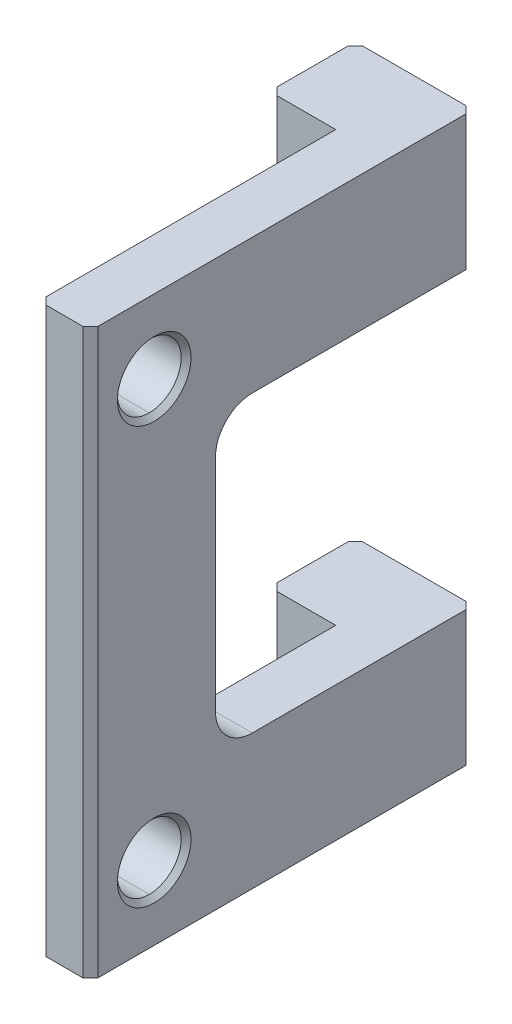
ISO-10303-21;
HEADER;
FILE_DESCRIPTION(('STEP AP214'),'2;1');
FILE_NAME('part.step','',(''),(''),'','','');
FILE_SCHEMA(('AUTOMOTIVE_DESIGN { 1 0 10303 214 1 1 1 1 }'));
ENDSEC;
DATA;
#1=APPLICATION_CONTEXT('core data for automotive mechanical design processes');
#2=APPLICATION_PROTOCOL_DEFINITION('international standard','automotive_design',2000,#1);
#3=PRODUCT_CONTEXT('',#1,'mechanical');
#4=PRODUCT('Part','Part','',(#3));
#5=PRODUCT_RELATED_PRODUCT_CATEGORY('part','',(#4));
#6=PRODUCT_DEFINITION_FORMATION('','',#4);
#7=PRODUCT_DEFINITION_CONTEXT('part definition',#1,'design');
#8=PRODUCT_DEFINITION('design','',#6,#7);
#9=PRODUCT_DEFINITION_SHAPE('','',#8);
#10=(LENGTH_UNIT() NAMED_UNIT(*) SI_UNIT(.MILLI.,.METRE.));
#11=(NAMED_UNIT(*) PLANE_ANGLE_UNIT() SI_UNIT($,.RADIAN.));
#12=(NAMED_UNIT(*) SI_UNIT($,.STERADIAN.) SOLID_ANGLE_UNIT());
#13=UNCERTAINTY_MEASURE_WITH_UNIT(LENGTH_MEASURE(1.E-05),#10,'distance_accuracy_value','');
#14=(GEOMETRIC_REPRESENTATION_CONTEXT(3) GLOBAL_UNCERTAINTY_ASSIGNED_CONTEXT((#13)) GLOBAL_UNIT_ASSIGNED_CONTEXT((#10,
#11,#12)) REPRESENTATION_CONTEXT('',''));
#15=CARTESIAN_POINT('',(0.,0.,0.));
#16=DIRECTION('',(0.,0.,1.));
#17=DIRECTION('',(1.,0.,0.));
#18=AXIS2_PLACEMENT_3D('',#15,#16,#17);
#19=CARTESIAN_POINT('',(51.9,-208.5,-24.175625));
#20=DIRECTION('',(0.,0.,-1.));
#21=DIRECTION('',(-1.,0.,0.));
#22=AXIS2_PLACEMENT_3D('',#19,#20,#21);
#23=CYLINDRICAL_SURFACE('',#22,1.02500000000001);
#24=DIRECTION('',(0.,0.,-1.));
#25=VECTOR('',#24,1.);
#26=CARTESIAN_POINT('',(52.,-209.520110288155,-24.175625));
#27=LINE('',#26,#25);
#28=CARTESIAN_POINT('',(52.,-209.520110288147,-24.0000000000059));
#29=VERTEX_POINT('',#28);
#30=CARTESIAN_POINT('',(52.,-209.520110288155,-24.5));
#31=VERTEX_POINT('',#30);
#32=EDGE_CURVE('E340',#29,#31,#27,.T.);
#33=ORIENTED_EDGE('',*,*,#32,.F.);
#34=CARTESIAN_POINT('',(51.9,-208.500000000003,-24.0000000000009));
#35=DIRECTION('',(0.,0.,-1.));
#36=DIRECTION('',(-1.,0.,0.));
#37=AXIS2_PLACEMENT_3D('',#34,#35,#36);
#38=CIRCLE('',#37,1.02499999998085);
#39=CARTESIAN_POINT('',(52.,-207.479889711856,-24.0000000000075));
#40=VERTEX_POINT('',#39);
#41=EDGE_CURVE('E239',#29,#40,#38,.F.);
#42=ORIENTED_EDGE('',*,*,#41,.T.);
#43=DIRECTION('',(0.,0.,-1.));
#44=VECTOR('',#43,1.);
#45=CARTESIAN_POINT('',(52.,-207.479889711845,-24.175625));
#46=LINE('',#45,#44);
#47=CARTESIAN_POINT('',(52.,-207.479889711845,-24.5));
#48=VERTEX_POINT('',#47);
#49=EDGE_CURVE('E343',#48,#40,#46,.F.);
#50=ORIENTED_EDGE('',*,*,#49,.F.);
#51=CARTESIAN_POINT('',(51.9,-208.5,-24.5));
#52=DIRECTION('',(0.,0.,-1.));
#53=DIRECTION('',(-1.,0.,0.));
#54=AXIS2_PLACEMENT_3D('',#51,#52,#53);
#55=CIRCLE('',#54,1.02500000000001);
#56=EDGE_CURVE('E728',#31,#48,#55,.T.);
#57=ORIENTED_EDGE('',*,*,#56,.F.);
#58=EDGE_LOOP('',(#33,#42,#50,#57));
#59=FACE_BOUND('',#58,.T.);
#60=CARTESIAN_POINT('',(51.9,-208.5,-27.7437499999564));
#61=DIRECTION('',(0.,0.,-1.));
#62=DIRECTION('',(-1.,0.,0.));
#63=AXIS2_PLACEMENT_3D('',#60,#61,#62);
#64=CIRCLE('',#63,1.02500000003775);
#65=CARTESIAN_POINT('',(50.8749999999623,-208.5,-27.7437499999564));
#66=VERTEX_POINT('',#65);
#67=EDGE_CURVE('E342',#66,#66,#64,.T.);
#68=ORIENTED_EDGE('',*,*,#67,.T.);
#69=EDGE_LOOP('',(#68));
#70=FACE_BOUND('',#69,.T.);
#71=ADVANCED_FACE('F17',(#59,#70),#23,.F.);
#72=CARTESIAN_POINT('',(51.9,-208.5,-27.9999999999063));
#73=DIRECTION('',(0.,0.,-1.));
#74=DIRECTION('',(-1.,0.,0.));
#75=AXIS2_PLACEMENT_3D('',#72,#73,#74);
#76=CONICAL_SURFACE('',#75,1.28124999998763,0.785398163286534);
#77=CARTESIAN_POINT('',(51.9,-208.5,-27.9999999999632));
#78=DIRECTION('',(0.,0.,-1.));
#79=DIRECTION('',(-1.,0.,0.));
#80=AXIS2_PLACEMENT_3D('',#77,#78,#79);
#81=CIRCLE('',#80,1.28125000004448);
#82=CARTESIAN_POINT('',(50.6187499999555,-208.5,-27.9999999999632));
#83=VERTEX_POINT('',#82);
#84=EDGE_CURVE('E720',#83,#83,#81,.F.);
#85=ORIENTED_EDGE('',*,*,#84,.F.);
#86=EDGE_LOOP('',(#85));
#87=FACE_BOUND('',#86,.T.);
#88=ORIENTED_EDGE('',*,*,#67,.F.);
#89=EDGE_LOOP('',(#88));
#90=FACE_BOUND('',#89,.T.);
#91=ADVANCED_FACE('F783',(#87,#90),#76,.F.);
#92=CARTESIAN_POINT('',(49.6,-211.,-24.5));
#93=DIRECTION('',(-0.707106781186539,0.,0.707106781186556));
#94=DIRECTION('',(0.707106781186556,0.,0.707106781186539));
#95=AXIS2_PLACEMENT_3D('',#92,#93,#94);
#96=PLANE('',#95);
#97=DIRECTION('',(0.,1.,0.));
#98=VECTOR('',#97,1.);
#99=CARTESIAN_POINT('',(49.3,-211.,-24.8));
#100=LINE('',#99,#98);
#101=CARTESIAN_POINT('',(49.3,-211.,-24.8));
#102=VERTEX_POINT('',#101);
#103=CARTESIAN_POINT('',(49.3,-205.5,-24.8));
#104=VERTEX_POINT('',#103);
#105=EDGE_CURVE('E376',#102,#104,#100,.T.);
#106=ORIENTED_EDGE('',*,*,#105,.F.);
#107=DIRECTION('',(0.707106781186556,0.,0.707106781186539));
#108=VECTOR('',#107,1.);
#109=CARTESIAN_POINT('',(49.6,-211.,-24.5));
#110=LINE('',#109,#108);
#111=CARTESIAN_POINT('',(49.6,-211.,-24.5));
#112=VERTEX_POINT('',#111);
#113=EDGE_CURVE('E337',#102,#112,#110,.T.);
#114=ORIENTED_EDGE('',*,*,#113,.T.);
#115=DIRECTION('',(0.,1.,0.));
#116=VECTOR('',#115,1.);
#117=CARTESIAN_POINT('',(49.6,-211.,-24.5));
#118=LINE('',#117,#116);
#119=CARTESIAN_POINT('',(49.6,-205.5,-24.5));
#120=VERTEX_POINT('',#119);
#121=EDGE_CURVE('E731',#120,#112,#118,.F.);
#122=ORIENTED_EDGE('',*,*,#121,.F.);
#123=DIRECTION('',(0.707106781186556,0.,0.707106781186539));
#124=VECTOR('',#123,1.);
#125=CARTESIAN_POINT('',(49.6,-205.5,-24.5));
#126=LINE('',#125,#124);
#127=EDGE_CURVE('E182',#120,#104,#126,.F.);
#128=ORIENTED_EDGE('',*,*,#127,.T.);
#129=EDGE_LOOP('',(#106,#114,#122,#128));
#130=FACE_BOUND('',#129,.T.);
#131=ADVANCED_FACE('F779',(#130),#96,.T.);
#132=CARTESIAN_POINT('',(49.3,-211.,-27.7));
#133=DIRECTION('',(-0.707106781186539,0.,-0.707106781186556));
#134=DIRECTION('',(-0.707106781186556,0.,0.707106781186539));
#135=AXIS2_PLACEMENT_3D('',#132,#133,#134);
#136=PLANE('',#135);
#137=DIRECTION('',(0.,1.,0.));
#138=VECTOR('',#137,1.);
#139=CARTESIAN_POINT('',(49.6,-211.,-28.));
#140=LINE('',#139,#138);
#141=CARTESIAN_POINT('',(49.6,-211.,-28.));
#142=VERTEX_POINT('',#141);
#143=CARTESIAN_POINT('',(49.6,-205.5,-28.));
#144=VERTEX_POINT('',#143);
#145=EDGE_CURVE('E717',#142,#144,#140,.T.);
#146=ORIENTED_EDGE('',*,*,#145,.F.);
#147=DIRECTION('',(-0.707106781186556,0.,0.707106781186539));
#148=VECTOR('',#147,1.);
#149=CARTESIAN_POINT('',(49.3,-211.,-27.7));
#150=LINE('',#149,#148);
#151=CARTESIAN_POINT('',(49.3,-211.,-27.7));
#152=VERTEX_POINT('',#151);
#153=EDGE_CURVE('E326',#142,#152,#150,.T.);
#154=ORIENTED_EDGE('',*,*,#153,.T.);
#155=DIRECTION('',(0.,1.,0.));
#156=VECTOR('',#155,1.);
#157=CARTESIAN_POINT('',(49.3,-211.,-27.7));
#158=LINE('',#157,#156);
#159=CARTESIAN_POINT('',(49.3,-205.5,-27.7));
#160=VERTEX_POINT('',#159);
#161=EDGE_CURVE('E373',#160,#152,#158,.F.);
#162=ORIENTED_EDGE('',*,*,#161,.F.);
#163=DIRECTION('',(-0.707106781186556,0.,0.707106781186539));
#164=VECTOR('',#163,1.);
#165=CARTESIAN_POINT('',(49.3,-205.5,-27.7));
#166=LINE('',#165,#164);
#167=EDGE_CURVE('E174',#160,#144,#166,.F.);
#168=ORIENTED_EDGE('',*,*,#167,.T.);
#169=EDGE_LOOP('',(#146,#154,#162,#168));
#170=FACE_BOUND('',#169,.T.);
#171=ADVANCED_FACE('F776',(#170),#136,.T.);
#172=CARTESIAN_POINT('',(51.9,-225.5,-24.175625));
#173=DIRECTION('',(0.,0.,-1.));
#174=DIRECTION('',(-1.,0.,0.));
#175=AXIS2_PLACEMENT_3D('',#172,#173,#174);
#176=CYLINDRICAL_SURFACE('',#175,1.025);
#177=DIRECTION('',(0.,0.,-1.));
#178=VECTOR('',#177,1.);
#179=CARTESIAN_POINT('',(52.,-226.520110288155,-24.175625));
#180=LINE('',#179,#178);
#181=CARTESIAN_POINT('',(52.,-226.520110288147,-23.9999999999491));
#182=VERTEX_POINT('',#181);
#183=CARTESIAN_POINT('',(52.,-226.520110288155,-24.5));
#184=VERTEX_POINT('',#183);
#185=EDGE_CURVE('E317',#182,#184,#180,.T.);
#186=ORIENTED_EDGE('',*,*,#185,.F.);
#187=CARTESIAN_POINT('',(51.8999999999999,-225.500000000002,-23.9999999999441));
#188=DIRECTION('',(0.,0.,-1.));
#189=DIRECTION('',(-1.,0.,0.));
#190=AXIS2_PLACEMENT_3D('',#187,#188,#189);
#191=CIRCLE('',#190,1.02499999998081);
#192=CARTESIAN_POINT('',(52.,-224.479889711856,-23.9999999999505));
#193=VERTEX_POINT('',#192);
#194=EDGE_CURVE('E301',#182,#193,#191,.F.);
#195=ORIENTED_EDGE('',*,*,#194,.T.);
#196=DIRECTION('',(0.,0.,-1.));
#197=VECTOR('',#196,1.);
#198=CARTESIAN_POINT('',(52.,-224.479889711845,-24.175625));
#199=LINE('',#198,#197);
#200=CARTESIAN_POINT('',(52.,-224.479889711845,-24.5));
#201=VERTEX_POINT('',#200);
#202=EDGE_CURVE('E324',#201,#193,#199,.F.);
#203=ORIENTED_EDGE('',*,*,#202,.F.);
#204=CARTESIAN_POINT('',(51.9,-225.5,-24.5));
#205=DIRECTION('',(0.,0.,-1.));
#206=DIRECTION('',(-1.,0.,0.));
#207=AXIS2_PLACEMENT_3D('',#204,#205,#206);
#208=CIRCLE('',#207,1.025);
#209=EDGE_CURVE('E352',#184,#201,#208,.T.);
#210=ORIENTED_EDGE('',*,*,#209,.F.);
#211=EDGE_LOOP('',(#186,#195,#203,#210));
#212=FACE_BOUND('',#211,.T.);
#213=CARTESIAN_POINT('',(51.9,-225.5,-27.7437499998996));
#214=DIRECTION('',(0.,0.,-1.));
#215=DIRECTION('',(-1.,0.,0.));
#216=AXIS2_PLACEMENT_3D('',#213,#214,#215);
#217=CIRCLE('',#216,1.02500000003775);
#218=CARTESIAN_POINT('',(50.8749999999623,-225.5,-27.7437499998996));
#219=VERTEX_POINT('',#218);
#220=EDGE_CURVE('E311',#219,#219,#217,.T.);
#221=ORIENTED_EDGE('',*,*,#220,.T.);
#222=EDGE_LOOP('',(#221));
#223=FACE_BOUND('',#222,.T.);
#224=ADVANCED_FACE('F751',(#212,#223),#176,.F.);
#225=CARTESIAN_POINT('',(49.6,-228.5,-24.5));
#226=DIRECTION('',(-0.707106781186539,0.,0.707106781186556));
#227=DIRECTION('',(0.707106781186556,0.,0.707106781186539));
#228=AXIS2_PLACEMENT_3D('',#225,#226,#227);
#229=PLANE('',#228);
#230=DIRECTION('',(0.,1.,0.));
#231=VECTOR('',#230,1.);
#232=CARTESIAN_POINT('',(49.3,-228.5,-24.8));
#233=LINE('',#232,#231);
#234=CARTESIAN_POINT('',(49.3,-228.5,-24.8));
#235=VERTEX_POINT('',#234);
#236=CARTESIAN_POINT('',(49.3,-223.,-24.8));
#237=VERTEX_POINT('',#236);
#238=EDGE_CURVE('E353',#235,#237,#233,.T.);
#239=ORIENTED_EDGE('',*,*,#238,.F.);
#240=DIRECTION('',(0.707106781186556,0.,0.707106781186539));
#241=VECTOR('',#240,1.);
#242=CARTESIAN_POINT('',(49.6,-228.5,-24.5));
#243=LINE('',#242,#241);
#244=CARTESIAN_POINT('',(49.6,-228.5,-24.5));
#245=VERTEX_POINT('',#244);
#246=EDGE_CURVE('E316',#235,#245,#243,.T.);
#247=ORIENTED_EDGE('',*,*,#246,.T.);
#248=DIRECTION('',(0.,1.,0.));
#249=VECTOR('',#248,1.);
#250=CARTESIAN_POINT('',(49.6,-228.5,-24.5));
#251=LINE('',#250,#249);
#252=CARTESIAN_POINT('',(49.6,-223.,-24.5));
#253=VERTEX_POINT('',#252);
#254=EDGE_CURVE('E669',#253,#245,#251,.F.);
#255=ORIENTED_EDGE('',*,*,#254,.F.);
#256=DIRECTION('',(0.707106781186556,0.,0.707106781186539));
#257=VECTOR('',#256,1.);
#258=CARTESIAN_POINT('',(49.6,-223.,-24.5));
#259=LINE('',#258,#257);
#260=EDGE_CURVE('E314',#253,#237,#259,.F.);
#261=ORIENTED_EDGE('',*,*,#260,.T.);
#262=EDGE_LOOP('',(#239,#247,#255,#261));
#263=FACE_BOUND('',#262,.T.);
#264=ADVANCED_FACE('F770',(#263),#229,.T.);
#265=CARTESIAN_POINT('',(51.9,-225.5,-27.9999999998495));
#266=DIRECTION('',(0.,0.,-1.));
#267=DIRECTION('',(-1.,0.,0.));
#268=AXIS2_PLACEMENT_3D('',#265,#266,#267);
#269=CONICAL_SURFACE('',#268,1.28124999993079,0.785398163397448);
#270=CARTESIAN_POINT('',(51.9,-225.5,-27.9999999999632));
#271=DIRECTION('',(0.,0.,-1.));
#272=DIRECTION('',(-1.,0.,0.));
#273=AXIS2_PLACEMENT_3D('',#270,#271,#272);
#274=CIRCLE('',#273,1.28125000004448);
#275=CARTESIAN_POINT('',(50.6187499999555,-225.5,-27.9999999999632));
#276=VERTEX_POINT('',#275);
#277=EDGE_CURVE('E454',#276,#276,#274,.F.);
#278=ORIENTED_EDGE('',*,*,#277,.F.);
#279=EDGE_LOOP('',(#278));
#280=FACE_BOUND('',#279,.T.);
#281=ORIENTED_EDGE('',*,*,#220,.F.);
#282=EDGE_LOOP('',(#281));
#283=FACE_BOUND('',#282,.T.);
#284=ADVANCED_FACE('F763',(#280,#283),#269,.F.);
#285=CARTESIAN_POINT('',(49.3,-228.5,-27.7));
#286=DIRECTION('',(-0.707106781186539,0.,-0.707106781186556));
#287=DIRECTION('',(-0.707106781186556,0.,0.707106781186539));
#288=AXIS2_PLACEMENT_3D('',#285,#286,#287);
#289=PLANE('',#288);
#290=DIRECTION('',(0.,1.,0.));
#291=VECTOR('',#290,1.);
#292=CARTESIAN_POINT('',(49.6,-228.5,-28.));
#293=LINE('',#292,#291);
#294=CARTESIAN_POINT('',(49.6,-228.5,-28.));
#295=VERTEX_POINT('',#294);
#296=CARTESIAN_POINT('',(49.6,-223.,-28.));
#297=VERTEX_POINT('',#296);
#298=EDGE_CURVE('E453',#295,#297,#293,.T.);
#299=ORIENTED_EDGE('',*,*,#298,.F.);
#300=DIRECTION('',(-0.707106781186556,0.,0.707106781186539));
#301=VECTOR('',#300,1.);
#302=CARTESIAN_POINT('',(49.3,-228.5,-27.7));
#303=LINE('',#302,#301);
#304=CARTESIAN_POINT('',(49.3,-228.5,-27.7));
#305=VERTEX_POINT('',#304);
#306=EDGE_CURVE('E305',#295,#305,#303,.T.);
#307=ORIENTED_EDGE('',*,*,#306,.T.);
#308=DIRECTION('',(0.,1.,0.));
#309=VECTOR('',#308,1.);
#310=CARTESIAN_POINT('',(49.3,-228.5,-27.7));
#311=LINE('',#310,#309);
#312=CARTESIAN_POINT('',(49.3,-223.,-27.7));
#313=VERTEX_POINT('',#312);
#314=EDGE_CURVE('E349',#313,#305,#311,.F.);
#315=ORIENTED_EDGE('',*,*,#314,.F.);
#316=DIRECTION('',(-0.707106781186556,0.,0.707106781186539));
#317=VECTOR('',#316,1.);
#318=CARTESIAN_POINT('',(49.3,-223.,-27.7));
#319=LINE('',#318,#317);
#320=EDGE_CURVE('E307',#313,#297,#319,.F.);
#321=ORIENTED_EDGE('',*,*,#320,.T.);
#322=EDGE_LOOP('',(#299,#307,#315,#321));
#323=FACE_BOUND('',#322,.T.);
#324=ADVANCED_FACE('F756',(#323),#289,.T.);
#325=CARTESIAN_POINT('',(51.8999999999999,-225.500000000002,-23.9999999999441));
#326=DIRECTION('',(0.,0.,-1.));
#327=DIRECTION('',(-1.,0.,0.));
#328=AXIS2_PLACEMENT_3D('',#325,#326,#327);
#329=CONICAL_SURFACE('',#328,1.02499999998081,1.02974425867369);
#330=CARTESIAN_POINT('',(52.,-224.479889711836,-23.9999999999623));
#331=CARTESIAN_POINT('',(52.,-224.521173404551,-23.9753118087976));
#332=CARTESIAN_POINT('',(52.,-224.562463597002,-23.9506345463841));
#333=CARTESIAN_POINT('',(52.,-224.645062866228,-23.9013114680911));
#334=CARTESIAN_POINT('',(52.,-224.686371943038,-23.8766656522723));
#335=CARTESIAN_POINT('',(52.,-224.810461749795,-23.8027150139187));
#336=CARTESIAN_POINT('',(52.,-224.893279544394,-23.7534721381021));
#337=CARTESIAN_POINT('',(52.,-225.019384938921,-23.679045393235));
#338=CARTESIAN_POINT('',(52.,-225.062555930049,-23.6536644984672));
#339=CARTESIAN_POINT('',(52.,-225.127445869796,-23.6158732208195));
#340=CARTESIAN_POINT('',(52.,-225.149086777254,-23.6033292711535));
#341=CARTESIAN_POINT('',(52.,-225.192463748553,-23.5783910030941));
#342=CARTESIAN_POINT('',(52.,-225.214199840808,-23.565996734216));
#343=CARTESIAN_POINT('',(52.,-225.259087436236,-23.5407671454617));
#344=CARTESIAN_POINT('',(52.,-225.282248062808,-23.5279478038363));
#345=CARTESIAN_POINT('',(52.,-225.317262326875,-23.509243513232));
#346=CARTESIAN_POINT('',(52.,-225.328976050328,-23.5030978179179));
#347=CARTESIAN_POINT('',(52.,-225.352552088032,-23.4911001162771));
#348=CARTESIAN_POINT('',(52.,-225.364414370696,-23.4852480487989));
#349=CARTESIAN_POINT('',(52.,-225.389732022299,-23.4734169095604));
#350=CARTESIAN_POINT('',(52.,-225.403215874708,-23.4674982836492));
#351=CARTESIAN_POINT('',(52.,-225.430673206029,-23.4569529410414));
#352=CARTESIAN_POINT('',(52.,-225.444644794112,-23.4523217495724));
#353=CARTESIAN_POINT('',(52.,-225.469320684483,-23.4467117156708));
#354=CARTESIAN_POINT('',(52.,-225.479860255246,-23.4450770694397));
#355=CARTESIAN_POINT('',(52.,-225.501026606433,-23.4438782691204));
#356=CARTESIAN_POINT('',(52.,-225.51165280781,-23.4443051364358));
#357=CARTESIAN_POINT('',(52.,-225.536853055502,-23.4475583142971));
#358=CARTESIAN_POINT('',(52.,-225.551295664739,-23.4512807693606));
#359=CARTESIAN_POINT('',(52.,-225.579678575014,-23.460602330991));
#360=CARTESIAN_POINT('',(52.,-225.593609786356,-23.4662254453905));
#361=CARTESIAN_POINT('',(52.,-225.623240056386,-23.4792614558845));
#362=CARTESIAN_POINT('',(52.,-225.638875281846,-23.4868167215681));
#363=CARTESIAN_POINT('',(52.,-225.669880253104,-23.502458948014));
#364=CARTESIAN_POINT('',(52.,-225.685249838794,-23.5105462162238));
#365=CARTESIAN_POINT('',(52.,-225.731179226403,-23.5352332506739));
#366=CARTESIAN_POINT('',(52.,-225.761520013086,-23.5522387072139));
#367=CARTESIAN_POINT('',(52.,-225.821809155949,-23.5865253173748));
#368=CARTESIAN_POINT('',(52.,-225.851758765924,-23.6038043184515));
#369=CARTESIAN_POINT('',(52.,-225.911523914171,-23.6385406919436));
#370=CARTESIAN_POINT('',(52.,-225.94133953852,-23.6559979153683));
#371=CARTESIAN_POINT('',(52.,-226.016903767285,-23.7004123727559));
#372=CARTESIAN_POINT('',(52.,-226.062612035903,-23.7274378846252));
#373=CARTESIAN_POINT('',(52.,-226.153975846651,-23.7816095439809));
#374=CARTESIAN_POINT('',(52.,-226.199631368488,-23.8087557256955));
#375=CARTESIAN_POINT('',(52.,-226.291111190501,-23.8632337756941));
#376=CARTESIAN_POINT('',(52.,-226.336935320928,-23.8905659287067));
#377=CARTESIAN_POINT('',(52.,-226.42854486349,-23.9452623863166));
#378=CARTESIAN_POINT('',(52.,-226.474330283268,-23.9726266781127));
#379=CARTESIAN_POINT('',(52.,-226.520110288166,-23.9999999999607));
#380=B_SPLINE_CURVE_WITH_KNOTS('',3,(#330,#331,#332,#333,#334,#335,#336,#337,#338,#339,#340,
#341,#342,#343,#344,#345,#346,#347,#348,#349,#350,#351,#352,#353,#354,#355,#356,#357,#358,#359,
#360,#361,#362,#363,#364,#365,#366,#367,#368,#369,#370,#371,#372,#373,#374,#375,#376,#377,#378,
#379),.UNSPECIFIED.,.F.,.F.,(4,2,2,2,2,2,2,2,2,2,2,2,2,2,2,2,2,2,2,2,2,2,2,2,4),(0.,
0.1443074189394,0.288615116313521,0.577669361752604,0.727906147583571,0.802946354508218,
0.878010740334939,0.957418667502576,0.997100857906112,1.0367747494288,1.08093418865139,
1.1249381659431,1.15677527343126,1.18847384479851,1.23292374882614,1.27795750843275,
1.33002678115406,1.38212641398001,1.48645818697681,1.59018893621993,1.69383910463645,
1.85313938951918,2.01248818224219,2.1725571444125,2.33257581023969),.UNSPECIFIED.);
#381=EDGE_CURVE('E286',#193,#182,#380,.T.);
#382=ORIENTED_EDGE('',*,*,#381,.F.);
#383=ORIENTED_EDGE('',*,*,#194,.F.);
#384=EDGE_LOOP('',(#382,#383));
#385=FACE_BOUND('',#384,.T.);
#386=ADVANCED_FACE('F754',(#385),#329,.F.);
#387=CARTESIAN_POINT('',(52.3,-228.5,-12.4));
#388=DIRECTION('',(-0.707106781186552,0.,0.707106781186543));
#389=DIRECTION('',(0.707106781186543,0.,0.707106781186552));
#390=AXIS2_PLACEMENT_3D('',#387,#388,#389);
#391=PLANE('',#390);
#392=DIRECTION('',(0.,1.,0.));
#393=VECTOR('',#392,1.);
#394=CARTESIAN_POINT('',(52.,-228.5,-12.7));
#395=LINE('',#394,#393);
#396=CARTESIAN_POINT('',(52.,-228.5,-12.7));
#397=VERTEX_POINT('',#396);
#398=CARTESIAN_POINT('',(52.,-205.5,-12.7));
#399=VERTEX_POINT('',#398);
#400=EDGE_CURVE('E269',#397,#399,#395,.T.);
#401=ORIENTED_EDGE('',*,*,#400,.F.);
#402=DIRECTION('',(0.707106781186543,0.,0.707106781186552));
#403=VECTOR('',#402,1.);
#404=CARTESIAN_POINT('',(52.3,-228.5,-12.4));
#405=LINE('',#404,#403);
#406=CARTESIAN_POINT('',(52.3000002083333,-228.5,-12.3999999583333));
#407=VERTEX_POINT('',#406);
#408=EDGE_CURVE('E265',#397,#407,#405,.T.);
#409=ORIENTED_EDGE('',*,*,#408,.T.);
#410=DIRECTION('',(0.,1.,0.));
#411=VECTOR('',#410,1.);
#412=CARTESIAN_POINT('',(52.30000025,-228.5,-12.4));
#413=LINE('',#412,#411);
#414=CARTESIAN_POINT('',(52.3000001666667,-205.5,-12.4));
#415=VERTEX_POINT('',#414);
#416=EDGE_CURVE('E370',#415,#407,#413,.F.);
#417=ORIENTED_EDGE('',*,*,#416,.F.);
#418=DIRECTION('',(0.707106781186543,0.,0.707106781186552));
#419=VECTOR('',#418,1.);
#420=CARTESIAN_POINT('',(52.3,-205.5,-12.4));
#421=LINE('',#420,#419);
#422=EDGE_CURVE('E304',#415,#399,#421,.F.);
#423=ORIENTED_EDGE('',*,*,#422,.T.);
#424=EDGE_LOOP('',(#401,#409,#417,#423));
#425=FACE_BOUND('',#424,.T.);
#426=ADVANCED_FACE('F755',(#425),#391,.T.);
#427=CARTESIAN_POINT('',(51.9,-208.500000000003,-24.0000000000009));
#428=DIRECTION('',(0.,0.,-1.));
#429=DIRECTION('',(0.,1.,0.));
#430=AXIS2_PLACEMENT_3D('',#427,#428,#429);
#431=CONICAL_SURFACE('',#430,1.02499999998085,1.02974425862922);
#432=CARTESIAN_POINT('',(52.,-207.479889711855,-24.000000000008));
#433=CARTESIAN_POINT('',(52.,-207.521173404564,-23.975311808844));
#434=CARTESIAN_POINT('',(52.,-207.562463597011,-23.9506345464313));
#435=CARTESIAN_POINT('',(52.,-207.645062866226,-23.9013114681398));
#436=CARTESIAN_POINT('',(52.,-207.686371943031,-23.8766656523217));
#437=CARTESIAN_POINT('',(52.,-207.81046174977,-23.8027150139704));
#438=CARTESIAN_POINT('',(52.,-207.893279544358,-23.7534721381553));
#439=CARTESIAN_POINT('',(52.,-208.019384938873,-23.6790453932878));
#440=CARTESIAN_POINT('',(52.,-208.06255593,-23.6536644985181));
#441=CARTESIAN_POINT('',(52.,-208.127445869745,-23.6158732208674));
#442=CARTESIAN_POINT('',(52.,-208.149086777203,-23.6033292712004));
#443=CARTESIAN_POINT('',(52.,-208.192463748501,-23.5783910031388));
#444=CARTESIAN_POINT('',(52.,-208.214199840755,-23.5659967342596));
#445=CARTESIAN_POINT('',(52.,-208.259087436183,-23.5407671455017));
#446=CARTESIAN_POINT('',(52.,-208.282248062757,-23.5279478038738));
#447=CARTESIAN_POINT('',(52.,-208.317262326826,-23.5092435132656));
#448=CARTESIAN_POINT('',(52.,-208.328976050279,-23.5030978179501));
#449=CARTESIAN_POINT('',(52.,-208.352552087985,-23.4911001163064));
#450=CARTESIAN_POINT('',(52.,-208.364414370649,-23.4852480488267));
#451=CARTESIAN_POINT('',(52.,-208.389732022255,-23.473416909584));
#452=CARTESIAN_POINT('',(52.,-208.403215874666,-23.4674982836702));
#453=CARTESIAN_POINT('',(52.,-208.430673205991,-23.4569529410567));
#454=CARTESIAN_POINT('',(52.,-208.444644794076,-23.4523217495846));
#455=CARTESIAN_POINT('',(52.,-208.469320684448,-23.4467117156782));
#456=CARTESIAN_POINT('',(52.,-208.47986025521,-23.445077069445));
#457=CARTESIAN_POINT('',(52.,-208.501026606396,-23.4438782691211));
#458=CARTESIAN_POINT('',(52.,-208.511652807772,-23.4443051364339));
#459=CARTESIAN_POINT('',(52.,-208.536853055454,-23.4475583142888));
#460=CARTESIAN_POINT('',(52.,-208.551295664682,-23.4512807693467));
#461=CARTESIAN_POINT('',(52.,-208.579678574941,-23.4606023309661));
#462=CARTESIAN_POINT('',(52.,-208.593609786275,-23.4662254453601));
#463=CARTESIAN_POINT('',(52.,-208.623240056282,-23.4792614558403));
#464=CARTESIAN_POINT('',(52.,-208.638875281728,-23.4868167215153));
#465=CARTESIAN_POINT('',(52.,-208.669880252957,-23.502458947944));
#466=CARTESIAN_POINT('',(52.,-208.685249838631,-23.5105462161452));
#467=CARTESIAN_POINT('',(52.,-208.731179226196,-23.5352332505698));
#468=CARTESIAN_POINT('',(52.,-208.76152001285,-23.552238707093));
#469=CARTESIAN_POINT('',(52.,-208.821809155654,-23.5865253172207));
#470=CARTESIAN_POINT('',(52.,-208.8517587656,-23.6038043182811));
#471=CARTESIAN_POINT('',(52.,-208.911523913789,-23.6385406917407));
#472=CARTESIAN_POINT('',(52.,-208.941339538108,-23.6559979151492));
#473=CARTESIAN_POINT('',(52.,-209.01690376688,-23.7004123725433));
#474=CARTESIAN_POINT('',(52.,-209.062612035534,-23.7274378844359));
#475=CARTESIAN_POINT('',(52.,-209.153975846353,-23.7816095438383));
#476=CARTESIAN_POINT('',(52.,-209.199631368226,-23.8087557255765));
#477=CARTESIAN_POINT('',(52.,-209.291111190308,-23.8632337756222));
#478=CARTESIAN_POINT('',(52.,-209.33693532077,-23.8905659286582));
#479=CARTESIAN_POINT('',(52.,-209.428544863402,-23.945262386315));
#480=CARTESIAN_POINT('',(52.,-209.474330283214,-23.9726266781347));
#481=CARTESIAN_POINT('',(52.,-209.520110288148,-24.0000000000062));
#482=B_SPLINE_CURVE_WITH_KNOTS('',3,(#432,#433,#434,#435,#436,#437,#438,#439,#440,#441,#442,
#443,#444,#445,#446,#447,#448,#449,#450,#451,#452,#453,#454,#455,#456,#457,#458,#459,#460,#461,
#462,#463,#464,#465,#466,#467,#468,#469,#470,#471,#472,#473,#474,#475,#476,#477,#478,#479,#480,
#481),.UNSPECIFIED.,.F.,.F.,(4,2,2,2,2,2,2,2,2,2,2,2,2,2,2,2,2,2,2,2,2,2,2,2,4),(0.,
0.144307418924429,0.288615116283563,0.577669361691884,0.727906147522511,0.802946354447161,
0.878010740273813,0.95741866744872,0.997100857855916,1.03677474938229,1.08093418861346,
1.12493816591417,1.15677527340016,1.18847384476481,1.23292374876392,1.27795750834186,
1.3300267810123,1.3821264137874,1.48645818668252,1.59018893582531,1.6938391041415,
1.85313938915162,2.01248818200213,2.17255714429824,2.3325758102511),.UNSPECIFIED.);
#483=EDGE_CURVE('E249',#40,#29,#482,.T.);
#484=ORIENTED_EDGE('',*,*,#483,.F.);
#485=ORIENTED_EDGE('',*,*,#41,.F.);
#486=EDGE_LOOP('',(#484,#485));
#487=FACE_BOUND('',#486,.T.);
#488=ADVANCED_FACE('F424',(#487),#431,.F.);
#489=CARTESIAN_POINT('',(54.09,-224.2,-15.));
#490=CARTESIAN_POINT('',(54.09,-224.2,-17.5999999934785));
#491=CARTESIAN_POINT('',(54.09,-226.799999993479,-17.5999999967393));
#492=CARTESIAN_POINT('',(54.09,-226.8,-15.0000000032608));
#493=CARTESIAN_POINT('',(51.81,-224.2,-15.));
#494=CARTESIAN_POINT('',(51.81,-224.2,-17.5999999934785));
#495=CARTESIAN_POINT('',(51.81,-226.799999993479,-17.5999999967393));
#496=CARTESIAN_POINT('',(51.81,-226.8,-15.0000000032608));
#497=(BOUNDED_SURFACE() B_SPLINE_SURFACE(1,3,((#489,#490,#491,#492),(#493,#494,#495,#496)),
.UNSPECIFIED.,.F.,.F.,.F.) B_SPLINE_SURFACE_WITH_KNOTS((2,2),(4,4),(0.,1.),(0.,1.),
.UNSPECIFIED.) GEOMETRIC_REPRESENTATION_ITEM() RATIONAL_B_SPLINE_SURFACE(((1.,0.333333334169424,
0.333333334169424,1.),(1.,0.333333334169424,0.333333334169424,1.))) REPRESENTATION_ITEM('') SURFACE());
#498=DIRECTION('',(-1.,0.,0.));
#499=VECTOR('',#498,1.);
#500=CARTESIAN_POINT('',(54.09,-224.199999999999,-14.999999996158));
#501=LINE('',#500,#499);
#502=CARTESIAN_POINT('',(53.8999999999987,-224.199999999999,-14.999999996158));
#503=VERTEX_POINT('',#502);
#504=CARTESIAN_POINT('',(52.,-224.199999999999,-14.9999999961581));
#505=VERTEX_POINT('',#504);
#506=EDGE_CURVE('E238',#503,#505,#501,.T.);
#507=CARTESIAN_POINT('',(52.,-226.8,-15.0000000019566));
#508=CARTESIAN_POINT('',(52.,-226.800000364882,-15.0365743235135));
#509=CARTESIAN_POINT('',(52.,-226.798455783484,-15.0731324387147));
#510=CARTESIAN_POINT('',(52.,-226.792294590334,-15.1459851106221));
#511=CARTESIAN_POINT('',(52.,-226.78767829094,-15.182279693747));
#512=CARTESIAN_POINT('',(52.,-226.769267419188,-15.2903194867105));
#513=CARTESIAN_POINT('',(52.,-226.750910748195,-15.3613369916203));
#514=CARTESIAN_POINT('',(52.,-226.702512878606,-15.4993095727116));
#515=CARTESIAN_POINT('',(52.,-226.672466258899,-15.5662627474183));
#516=CARTESIAN_POINT('',(52.,-226.619342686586,-15.6621258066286));
#517=CARTESIAN_POINT('',(52.,-226.600290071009,-15.6933221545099));
#518=CARTESIAN_POINT('',(52.,-226.559609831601,-15.7540314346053));
#519=CARTESIAN_POINT('',(52.,-226.537979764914,-15.7835427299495));
#520=CARTESIAN_POINT('',(52.,-226.469493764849,-15.8691440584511));
#521=CARTESIAN_POINT('',(52.,-226.418996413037,-15.9223836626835));
#522=CARTESIAN_POINT('',(52.,-226.309770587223,-16.0196165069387));
#523=CARTESIAN_POINT('',(52.,-226.25104209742,-16.063609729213));
#524=CARTESIAN_POINT('',(52.,-226.158082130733,-16.121726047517));
#525=CARTESIAN_POINT('',(52.,-226.12626032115,-16.1397957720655));
#526=CARTESIAN_POINT('',(52.,-226.0612407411,-16.1731766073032));
#527=CARTESIAN_POINT('',(52.,-226.028044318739,-16.1884903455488));
#528=CARTESIAN_POINT('',(52.,-225.926675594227,-16.2301525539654));
#529=CARTESIAN_POINT('',(52.,-225.856694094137,-16.252240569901));
#530=CARTESIAN_POINT('',(52.,-225.714050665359,-16.2843418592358));
#531=CARTESIAN_POINT('',(52.,-225.641388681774,-16.2943548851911));
#532=CARTESIAN_POINT('',(52.,-225.495404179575,-16.3020441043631));
#533=CARTESIAN_POINT('',(52.,-225.422081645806,-16.2997200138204));
#534=CARTESIAN_POINT('',(52.,-225.276868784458,-16.2827921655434));
#535=CARTESIAN_POINT('',(52.,-225.204978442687,-16.2681885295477));
#536=CARTESIAN_POINT('',(52.,-225.064676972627,-16.2271264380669));
#537=CARTESIAN_POINT('',(52.,-224.996265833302,-16.2006680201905));
#538=CARTESIAN_POINT('',(52.,-224.864826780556,-16.1366145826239));
#539=CARTESIAN_POINT('',(52.,-224.801799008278,-16.0990192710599));
#540=CARTESIAN_POINT('',(52.,-224.712730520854,-16.0351554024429));
#541=CARTESIAN_POINT('',(52.,-224.68394856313,-16.0126175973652));
#542=CARTESIAN_POINT('',(52.,-224.628354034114,-15.9651785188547));
#543=CARTESIAN_POINT('',(52.,-224.601543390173,-15.9402749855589));
#544=CARTESIAN_POINT('',(52.,-224.52444439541,-15.8623347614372));
#545=CARTESIAN_POINT('',(52.,-224.477409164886,-15.8060110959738));
#546=CARTESIAN_POINT('',(52.,-224.393477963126,-15.6862617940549));
#547=CARTESIAN_POINT('',(52.,-224.356581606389,-15.6228364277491));
#548=CARTESIAN_POINT('',(52.,-224.309609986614,-15.5237502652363));
#549=CARTESIAN_POINT('',(52.,-224.295337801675,-15.4900264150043));
#550=CARTESIAN_POINT('',(52.,-224.269695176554,-15.4215302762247));
#551=CARTESIAN_POINT('',(52.,-224.258322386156,-15.3867588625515));
#552=CARTESIAN_POINT('',(52.,-224.22869626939,-15.2812506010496));
#553=CARTESIAN_POINT('',(52.0000000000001,-224.214871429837,-15.2091849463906));
#554=CARTESIAN_POINT('',(52.,-224.204795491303,-15.1138905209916));
#555=CARTESIAN_POINT('',(52.,-224.202996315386,-15.0911301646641));
#556=CARTESIAN_POINT('',(52.,-224.200600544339,-15.0455839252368));
#557=CARTESIAN_POINT('',(52.,-224.200001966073,-15.022798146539));
#558=CARTESIAN_POINT('',(52.,-224.2,-14.9999999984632));
#559=B_SPLINE_CURVE_WITH_KNOTS('',3,(#507,#508,#509,#510,#511,#512,#513,#514,#515,#516,#517,
#518,#519,#520,#521,#522,#523,#524,#525,#526,#527,#528,#529,#530,#531,#532,#533,#534,#535,#536,
#537,#538,#539,#540,#541,#542,#543,#544,#545,#546,#547,#548,#549,#550,#551,#552,#553,#554,#555,
#556,#557,#558),.UNSPECIFIED.,.F.,.F.,(4,2,2,2,2,2,2,2,2,2,2,2,2,2,2,2,2,2,2,2,2,2,2,2,2,4),(0.,
0.109658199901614,0.219305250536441,0.438255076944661,0.657306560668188,0.766855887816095,
0.876509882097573,1.09553964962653,1.31456983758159,1.42423835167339,1.53380174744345,
1.75282471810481,1.97185217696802,2.19088467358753,2.40991499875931,2.62894462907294,
2.84798000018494,2.95753687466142,3.06719947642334,3.28623361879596,3.505259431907,
3.61500069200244,3.72465271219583,3.94351474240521,4.0119897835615,4.08035162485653),.UNSPECIFIED.);
#560=CARTESIAN_POINT('',(52.,-226.8,-15.0000000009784));
#561=VERTEX_POINT('',#560);
#562=EDGE_CURVE('E107',#561,#505,#559,.T.);
#563=DIRECTION('',(-1.,0.,0.));
#564=VECTOR('',#563,1.);
#565=CARTESIAN_POINT('',(54.09,-226.8,-15.0000000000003));
#566=LINE('',#565,#564);
#567=CARTESIAN_POINT('',(53.8999999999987,-226.8,-15.0000000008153));
#568=VERTEX_POINT('',#567);
#569=EDGE_CURVE('E21',#561,#568,#566,.F.);
#570=CARTESIAN_POINT('',(53.8999999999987,-225.5,-15.));
#571=DIRECTION('',(1.,0.,0.));
#572=DIRECTION('',(0.,0.,-1.));
#573=AXIS2_PLACEMENT_3D('',#570,#571,#572);
#574=CIRCLE('',#573,1.30000000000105);
#575=EDGE_CURVE('E231',#568,#503,#574,.T.);
#576=ORIENTED_EDGE('',*,*,#506,.T.);
#577=ORIENTED_EDGE('',*,*,#562,.F.);
#578=ORIENTED_EDGE('',*,*,#569,.T.);
#579=ORIENTED_EDGE('',*,*,#575,.T.);
#580=EDGE_LOOP('',(#576,#577,#578,#579));
#581=FACE_BOUND('',#580,.T.);
#582=ADVANCED_FACE('F234',(#581),#497,.T.);
#583=CARTESIAN_POINT('',(54.09,-225.5,-15.0000000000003));
#584=DIRECTION('',(-1.,0.,0.));
#585=DIRECTION('',(0.,-1.,0.));
#586=AXIS2_PLACEMENT_3D('',#583,#584,#585);
#587=CYLINDRICAL_SURFACE('',#586,1.30000000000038);
#588=CARTESIAN_POINT('',(53.8999999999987,-225.5,-15.));
#589=DIRECTION('',(1.,0.,0.));
#590=DIRECTION('',(0.,0.,-1.));
#591=AXIS2_PLACEMENT_3D('',#588,#589,#590);
#592=CIRCLE('',#591,1.30000000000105);
#593=EDGE_CURVE('E241',#503,#568,#592,.T.);
#594=ORIENTED_EDGE('',*,*,#593,.T.);
#595=ORIENTED_EDGE('',*,*,#569,.F.);
#596=CARTESIAN_POINT('',(52.,-225.5,-15.0000000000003));
#597=DIRECTION('',(-1.,0.,0.));
#598=DIRECTION('',(0.,-1.,0.));
#599=AXIS2_PLACEMENT_3D('',#596,#597,#598);
#600=CIRCLE('',#599,1.30000000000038);
#601=EDGE_CURVE('E452',#505,#561,#600,.F.);
#602=ORIENTED_EDGE('',*,*,#601,.F.);
#603=ORIENTED_EDGE('',*,*,#506,.F.);
#604=EDGE_LOOP('',(#594,#595,#602,#603));
#605=FACE_BOUND('',#604,.T.);
#606=ADVANCED_FACE('F242',(#605),#587,.F.);
#607=CARTESIAN_POINT('',(54.09,-208.5,-15.0000000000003));
#608=DIRECTION('',(-1.,0.,0.));
#609=DIRECTION('',(0.,-1.,0.));
#610=AXIS2_PLACEMENT_3D('',#607,#608,#609);
#611=CYLINDRICAL_SURFACE('',#610,1.30000000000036);
#612=CARTESIAN_POINT('',(53.8999999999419,-208.5,-15.));
#613=DIRECTION('',(1.,0.,0.));
#614=DIRECTION('',(0.,0.,-1.));
#615=AXIS2_PLACEMENT_3D('',#612,#613,#614);
#616=CIRCLE('',#615,1.30000000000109);
#617=CARTESIAN_POINT('',(53.8999999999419,-207.199999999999,-15.));
#618=VERTEX_POINT('',#617);
#619=CARTESIAN_POINT('',(53.8999999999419,-209.8,-15.0000000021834));
#620=VERTEX_POINT('',#619);
#621=EDGE_CURVE('E244',#618,#620,#616,.T.);
#622=ORIENTED_EDGE('',*,*,#621,.T.);
#623=DIRECTION('',(-1.,0.,0.));
#624=VECTOR('',#623,1.);
#625=CARTESIAN_POINT('',(54.09,-209.8,-15.0000000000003));
#626=LINE('',#625,#624);
#627=CARTESIAN_POINT('',(52.,-209.8,-15.0000000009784));
#628=VERTEX_POINT('',#627);
#629=EDGE_CURVE('E260',#628,#620,#626,.F.);
#630=ORIENTED_EDGE('',*,*,#629,.F.);
#631=CARTESIAN_POINT('',(52.,-208.5,-15.0000000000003));
#632=DIRECTION('',(-1.,0.,0.));
#633=DIRECTION('',(0.,-1.,0.));
#634=AXIS2_PLACEMENT_3D('',#631,#632,#633);
#635=CIRCLE('',#634,1.30000000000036);
#636=CARTESIAN_POINT('',(52.,-207.2,-15.));
#637=VERTEX_POINT('',#636);
#638=EDGE_CURVE('E662',#637,#628,#635,.F.);
#639=ORIENTED_EDGE('',*,*,#638,.F.);
#640=DIRECTION('',(-1.,0.,0.));
#641=VECTOR('',#640,1.);
#642=CARTESIAN_POINT('',(52.95,-207.2,-15.));
#643=LINE('',#642,#641);
#644=EDGE_CURVE('E227',#618,#637,#643,.T.);
#645=ORIENTED_EDGE('',*,*,#644,.F.);
#646=EDGE_LOOP('',(#622,#630,#639,#645));
#647=FACE_BOUND('',#646,.T.);
#648=ADVANCED_FACE('F468',(#647),#611,.F.);
#649=CARTESIAN_POINT('',(54.09,-207.2,-15.));
#650=CARTESIAN_POINT('',(54.09,-207.2,-17.5999999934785));
#651=CARTESIAN_POINT('',(54.09,-209.799999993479,-17.5999999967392));
#652=CARTESIAN_POINT('',(54.09,-209.8,-15.0000000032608));
#653=CARTESIAN_POINT('',(51.81,-207.2,-15.));
#654=CARTESIAN_POINT('',(51.81,-207.2,-17.5999999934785));
#655=CARTESIAN_POINT('',(51.81,-209.799999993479,-17.5999999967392));
#656=CARTESIAN_POINT('',(51.81,-209.8,-15.0000000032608));
#657=(BOUNDED_SURFACE() B_SPLINE_SURFACE(1,3,((#649,#650,#651,#652),(#653,#654,#655,#656)),
.UNSPECIFIED.,.F.,.F.,.F.) B_SPLINE_SURFACE_WITH_KNOTS((2,2),(4,4),(0.,1.),(0.,1.),
.UNSPECIFIED.) GEOMETRIC_REPRESENTATION_ITEM() RATIONAL_B_SPLINE_SURFACE(((1.,0.333333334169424,
0.333333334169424,1.),(1.,0.333333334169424,0.333333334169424,1.))) REPRESENTATION_ITEM('') SURFACE());
#658=CARTESIAN_POINT('',(52.,-209.8,-15.0000000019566));
#659=CARTESIAN_POINT('',(52.,-209.800000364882,-15.0365743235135));
#660=CARTESIAN_POINT('',(52.,-209.798455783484,-15.0731324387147));
#661=CARTESIAN_POINT('',(52.,-209.792294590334,-15.1459851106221));
#662=CARTESIAN_POINT('',(52.,-209.78767829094,-15.182279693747));
#663=CARTESIAN_POINT('',(52.,-209.769267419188,-15.2903194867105));
#664=CARTESIAN_POINT('',(52.,-209.750910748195,-15.3613369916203));
#665=CARTESIAN_POINT('',(52.,-209.702512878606,-15.4993095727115));
#666=CARTESIAN_POINT('',(52.,-209.672466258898,-15.5662627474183));
#667=CARTESIAN_POINT('',(52.,-209.619342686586,-15.6621258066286));
#668=CARTESIAN_POINT('',(52.,-209.600290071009,-15.6933221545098));
#669=CARTESIAN_POINT('',(52.,-209.559609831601,-15.7540314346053));
#670=CARTESIAN_POINT('',(52.,-209.537979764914,-15.7835427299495));
#671=CARTESIAN_POINT('',(52.,-209.469493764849,-15.8691440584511));
#672=CARTESIAN_POINT('',(52.,-209.418996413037,-15.9223836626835));
#673=CARTESIAN_POINT('',(52.,-209.309770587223,-16.0196165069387));
#674=CARTESIAN_POINT('',(52.,-209.25104209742,-16.063609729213));
#675=CARTESIAN_POINT('',(52.,-209.158082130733,-16.121726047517));
#676=CARTESIAN_POINT('',(52.,-209.12626032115,-16.1397957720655));
#677=CARTESIAN_POINT('',(52.,-209.0612407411,-16.1731766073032));
#678=CARTESIAN_POINT('',(52.,-209.028044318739,-16.1884903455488));
#679=CARTESIAN_POINT('',(52.,-208.926675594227,-16.2301525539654));
#680=CARTESIAN_POINT('',(52.,-208.856694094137,-16.2522405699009));
#681=CARTESIAN_POINT('',(52.,-208.714050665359,-16.2843418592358));
#682=CARTESIAN_POINT('',(52.,-208.641388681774,-16.2943548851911));
#683=CARTESIAN_POINT('',(52.,-208.495404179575,-16.3020441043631));
#684=CARTESIAN_POINT('',(52.,-208.422081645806,-16.2997200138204));
#685=CARTESIAN_POINT('',(52.,-208.276868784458,-16.2827921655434));
#686=CARTESIAN_POINT('',(52.,-208.204978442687,-16.2681885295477));
#687=CARTESIAN_POINT('',(52.,-208.064676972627,-16.2271264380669));
#688=CARTESIAN_POINT('',(52.,-207.996265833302,-16.2006680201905));
#689=CARTESIAN_POINT('',(52.,-207.864826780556,-16.1366145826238));
#690=CARTESIAN_POINT('',(52.,-207.801799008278,-16.0990192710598));
#691=CARTESIAN_POINT('',(52.,-207.712730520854,-16.0351554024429));
#692=CARTESIAN_POINT('',(52.,-207.68394856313,-16.0126175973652));
#693=CARTESIAN_POINT('',(52.,-207.628354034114,-15.9651785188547));
#694=CARTESIAN_POINT('',(52.,-207.601543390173,-15.940274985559));
#695=CARTESIAN_POINT('',(52.,-207.52444439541,-15.8623347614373));
#696=CARTESIAN_POINT('',(52.,-207.477409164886,-15.8060110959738));
#697=CARTESIAN_POINT('',(52.,-207.393477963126,-15.6862617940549));
#698=CARTESIAN_POINT('',(52.,-207.35658160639,-15.6228364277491));
#699=CARTESIAN_POINT('',(52.,-207.309609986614,-15.5237502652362));
#700=CARTESIAN_POINT('',(52.,-207.295337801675,-15.490026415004));
#701=CARTESIAN_POINT('',(52.,-207.269695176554,-15.4215302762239));
#702=CARTESIAN_POINT('',(52.,-207.258322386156,-15.3867588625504));
#703=CARTESIAN_POINT('',(52.,-207.22869626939,-15.2812506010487));
#704=CARTESIAN_POINT('',(52.,-207.214871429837,-15.2091849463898));
#705=CARTESIAN_POINT('',(52.,-207.20479549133,-15.1138905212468));
#706=CARTESIAN_POINT('',(52.,-207.202996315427,-15.0911301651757));
#707=CARTESIAN_POINT('',(52.,-207.200600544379,-15.0455839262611));
#708=CARTESIAN_POINT('',(52.,-207.2000019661,-15.0227981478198));
#709=CARTESIAN_POINT('',(52.,-207.2,-15.));
#710=B_SPLINE_CURVE_WITH_KNOTS('',3,(#658,#659,#660,#661,#662,#663,#664,#665,#666,#667,#668,
#669,#670,#671,#672,#673,#674,#675,#676,#677,#678,#679,#680,#681,#682,#683,#684,#685,#686,#687,
#688,#689,#690,#691,#692,#693,#694,#695,#696,#697,#698,#699,#700,#701,#702,#703,#704,#705,#706,
#707,#708,#709),.UNSPECIFIED.,.F.,.F.,(4,2,2,2,2,2,2,2,2,2,2,2,2,2,2,2,2,2,2,2,2,2,2,2,2,4),(0.,
0.109658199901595,0.219305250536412,0.438255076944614,0.657306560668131,0.766855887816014,
0.876509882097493,1.09553964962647,1.31456983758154,1.42423835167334,1.53380174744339,
1.75282471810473,1.97185217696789,2.19088467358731,2.40991499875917,2.62894462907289,
2.84798000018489,2.95753687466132,3.06719947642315,3.2862336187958,3.50525943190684,
3.61500069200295,3.72465271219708,3.94351474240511,4.01198978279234,4.08035162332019),.UNSPECIFIED.);
#711=EDGE_CURVE('E440',#628,#637,#710,.T.);
#712=CARTESIAN_POINT('',(53.8999999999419,-208.5,-15.));
#713=DIRECTION('',(1.,0.,0.));
#714=DIRECTION('',(0.,0.,-1.));
#715=AXIS2_PLACEMENT_3D('',#712,#713,#714);
#716=CIRCLE('',#715,1.30000000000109);
#717=EDGE_CURVE('E411',#620,#618,#716,.T.);
#718=ORIENTED_EDGE('',*,*,#644,.T.);
#719=ORIENTED_EDGE('',*,*,#711,.F.);
#720=ORIENTED_EDGE('',*,*,#629,.T.);
#721=ORIENTED_EDGE('',*,*,#717,.T.);
#722=EDGE_LOOP('',(#718,#719,#720,#721));
#723=FACE_BOUND('',#722,.T.);
#724=ADVANCED_FACE('F470',(#723),#657,.T.);
#725=CARTESIAN_POINT('',(49.6,-211.,-24.5));
#726=DIRECTION('',(0.,0.,1.));
#727=DIRECTION('',(1.,0.,0.));
#728=AXIS2_PLACEMENT_3D('',#725,#726,#727);
#729=PLANE('',#728);
#730=DIRECTION('',(1.,0.,0.));
#731=VECTOR('',#730,1.);
#732=CARTESIAN_POINT('',(54.1,-205.5,-24.5));
#733=LINE('',#732,#731);
#734=CARTESIAN_POINT('',(52.,-205.5,-24.5));
#735=VERTEX_POINT('',#734);
#736=EDGE_CURVE('E276',#120,#735,#733,.T.);
#737=ORIENTED_EDGE('',*,*,#736,.F.);
#738=ORIENTED_EDGE('',*,*,#121,.T.);
#739=DIRECTION('',(1.,0.,0.));
#740=VECTOR('',#739,1.);
#741=CARTESIAN_POINT('',(54.1,-211.,-24.5));
#742=LINE('',#741,#740);
#743=CARTESIAN_POINT('',(52.,-211.,-24.5));
#744=VERTEX_POINT('',#743);
#745=EDGE_CURVE('E693',#744,#112,#742,.F.);
#746=ORIENTED_EDGE('',*,*,#745,.F.);
#747=DIRECTION('',(0.,1.,0.));
#748=VECTOR('',#747,1.);
#749=CARTESIAN_POINT('',(52.,-228.5,-24.5));
#750=LINE('',#749,#748);
#751=EDGE_CURVE('E247',#31,#744,#750,.F.);
#752=ORIENTED_EDGE('',*,*,#751,.F.);
#753=ORIENTED_EDGE('',*,*,#56,.T.);
#754=DIRECTION('',(0.,1.,0.));
#755=VECTOR('',#754,1.);
#756=CARTESIAN_POINT('',(52.,-228.5,-24.5));
#757=LINE('',#756,#755);
#758=EDGE_CURVE('E266',#735,#48,#757,.F.);
#759=ORIENTED_EDGE('',*,*,#758,.F.);
#760=EDGE_LOOP('',(#737,#738,#746,#752,#753,#759));
#761=FACE_BOUND('',#760,.T.);
#762=ADVANCED_FACE('F476',(#761),#729,.T.);
#763=CARTESIAN_POINT('',(53.8,-211.,-28.));
#764=DIRECTION('',(0.,0.,-1.));
#765=DIRECTION('',(-1.,0.,0.));
#766=AXIS2_PLACEMENT_3D('',#763,#764,#765);
#767=PLANE('',#766);
#768=ORIENTED_EDGE('',*,*,#145,.T.);
#769=DIRECTION('',(1.,0.,0.));
#770=VECTOR('',#769,1.);
#771=CARTESIAN_POINT('',(54.1,-205.5,-28.));
#772=LINE('',#771,#770);
#773=CARTESIAN_POINT('',(53.8,-205.5,-28.));
#774=VERTEX_POINT('',#773);
#775=EDGE_CURVE('E389',#774,#144,#772,.F.);
#776=ORIENTED_EDGE('',*,*,#775,.F.);
#777=DIRECTION('',(0.,1.,0.));
#778=VECTOR('',#777,1.);
#779=CARTESIAN_POINT('',(53.8,-211.,-28.));
#780=LINE('',#779,#778);
#781=CARTESIAN_POINT('',(53.8,-211.,-28.));
#782=VERTEX_POINT('',#781);
#783=EDGE_CURVE('E642',#782,#774,#780,.T.);
#784=ORIENTED_EDGE('',*,*,#783,.F.);
#785=DIRECTION('',(1.,0.,0.));
#786=VECTOR('',#785,1.);
#787=CARTESIAN_POINT('',(54.1,-211.,-28.));
#788=LINE('',#787,#786);
#789=EDGE_CURVE('E382',#142,#782,#788,.T.);
#790=ORIENTED_EDGE('',*,*,#789,.F.);
#791=EDGE_LOOP('',(#768,#776,#784,#790));
#792=FACE_BOUND('',#791,.T.);
#793=ORIENTED_EDGE('',*,*,#84,.T.);
#794=EDGE_LOOP('',(#793));
#795=FACE_BOUND('',#794,.T.);
#796=ADVANCED_FACE('F485',(#792,#795),#767,.T.);
#797=CARTESIAN_POINT('',(49.3,-211.,-27.7));
#798=DIRECTION('',(-1.,0.,0.));
#799=DIRECTION('',(0.,0.,1.));
#800=AXIS2_PLACEMENT_3D('',#797,#798,#799);
#801=PLANE('',#800);
#802=DIRECTION('',(0.,0.,1.));
#803=VECTOR('',#802,1.);
#804=CARTESIAN_POINT('',(49.3,-205.5,-12.4));
#805=LINE('',#804,#803);
#806=EDGE_CURVE('E386',#160,#104,#805,.T.);
#807=ORIENTED_EDGE('',*,*,#806,.F.);
#808=ORIENTED_EDGE('',*,*,#161,.T.);
#809=DIRECTION('',(0.,0.,-1.));
#810=VECTOR('',#809,1.);
#811=CARTESIAN_POINT('',(49.3,-211.,-19.));
#812=LINE('',#811,#810);
#813=EDGE_CURVE('E379',#102,#152,#812,.T.);
#814=ORIENTED_EDGE('',*,*,#813,.F.);
#815=ORIENTED_EDGE('',*,*,#105,.T.);
#816=EDGE_LOOP('',(#807,#808,#814,#815));
#817=FACE_BOUND('',#816,.T.);
#818=ADVANCED_FACE('F489',(#817),#801,.T.);
#819=CARTESIAN_POINT('',(52.3,-228.5,-12.4));
#820=DIRECTION('',(0.,0.,1.));
#821=DIRECTION('',(1.,0.,0.));
#822=AXIS2_PLACEMENT_3D('',#819,#820,#821);
#823=PLANE('',#822);
#824=DIRECTION('',(1.,0.,0.));
#825=VECTOR('',#824,1.);
#826=CARTESIAN_POINT('',(54.1,-205.5,-12.4));
#827=LINE('',#826,#825);
#828=CARTESIAN_POINT('',(53.7999998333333,-205.5,-12.3999999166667));
#829=VERTEX_POINT('',#828);
#830=EDGE_CURVE('E275',#415,#829,#827,.T.);
#831=ORIENTED_EDGE('',*,*,#830,.F.);
#832=ORIENTED_EDGE('',*,*,#416,.T.);
#833=DIRECTION('',(1.,0.,0.));
#834=VECTOR('',#833,1.);
#835=CARTESIAN_POINT('',(52.3,-228.5,-12.4));
#836=LINE('',#835,#834);
#837=CARTESIAN_POINT('',(53.7999999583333,-228.5,-12.3999999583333));
#838=VERTEX_POINT('',#837);
#839=EDGE_CURVE('E115',#407,#838,#836,.T.);
#840=ORIENTED_EDGE('',*,*,#839,.T.);
#841=DIRECTION('',(0.,1.,0.));
#842=VECTOR('',#841,1.);
#843=CARTESIAN_POINT('',(53.799999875,-228.5,-12.399999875));
#844=LINE('',#843,#842);
#845=EDGE_CURVE('E298',#829,#838,#844,.F.);
#846=ORIENTED_EDGE('',*,*,#845,.F.);
#847=EDGE_LOOP('',(#831,#832,#840,#846));
#848=FACE_BOUND('',#847,.T.);
#849=ADVANCED_FACE('F493',(#848),#823,.T.);
#850=CARTESIAN_POINT('',(49.3,-228.5,-27.7));
#851=DIRECTION('',(-1.,0.,0.));
#852=DIRECTION('',(0.,0.,1.));
#853=AXIS2_PLACEMENT_3D('',#850,#851,#852);
#854=PLANE('',#853);
#855=DIRECTION('',(0.,0.,1.));
#856=VECTOR('',#855,1.);
#857=CARTESIAN_POINT('',(49.3,-223.,-28.));
#858=LINE('',#857,#856);
#859=EDGE_CURVE('E361',#313,#237,#858,.T.);
#860=ORIENTED_EDGE('',*,*,#859,.F.);
#861=ORIENTED_EDGE('',*,*,#314,.T.);
#862=DIRECTION('',(0.,0.,-1.));
#863=VECTOR('',#862,1.);
#864=CARTESIAN_POINT('',(49.3,-228.5,-12.4));
#865=LINE('',#864,#863);
#866=EDGE_CURVE('E292',#235,#305,#865,.T.);
#867=ORIENTED_EDGE('',*,*,#866,.F.);
#868=ORIENTED_EDGE('',*,*,#238,.T.);
#869=EDGE_LOOP('',(#860,#861,#867,#868));
#870=FACE_BOUND('',#869,.T.);
#871=ADVANCED_FACE('F497',(#870),#854,.T.);
#872=CARTESIAN_POINT('',(49.6,-228.5,-24.5));
#873=DIRECTION('',(0.,0.,1.));
#874=DIRECTION('',(1.,0.,0.));
#875=AXIS2_PLACEMENT_3D('',#872,#873,#874);
#876=PLANE('',#875);
#877=DIRECTION('',(1.,0.,0.));
#878=VECTOR('',#877,1.);
#879=CARTESIAN_POINT('',(54.1,-228.5,-24.5));
#880=LINE('',#879,#878);
#881=CARTESIAN_POINT('',(52.,-228.5,-24.5));
#882=VERTEX_POINT('',#881);
#883=EDGE_CURVE('E289',#882,#245,#880,.F.);
#884=ORIENTED_EDGE('',*,*,#883,.F.);
#885=DIRECTION('',(0.,1.,0.));
#886=VECTOR('',#885,1.);
#887=CARTESIAN_POINT('',(52.,-228.5,-24.5));
#888=LINE('',#887,#886);
#889=EDGE_CURVE('E284',#184,#882,#888,.F.);
#890=ORIENTED_EDGE('',*,*,#889,.F.);
#891=ORIENTED_EDGE('',*,*,#209,.T.);
#892=DIRECTION('',(0.,1.,0.));
#893=VECTOR('',#892,1.);
#894=CARTESIAN_POINT('',(52.,-228.5,-24.5));
#895=LINE('',#894,#893);
#896=CARTESIAN_POINT('',(52.,-223.,-24.5));
#897=VERTEX_POINT('',#896);
#898=EDGE_CURVE('E659',#897,#201,#895,.F.);
#899=ORIENTED_EDGE('',*,*,#898,.F.);
#900=DIRECTION('',(1.,0.,0.));
#901=VECTOR('',#900,1.);
#902=CARTESIAN_POINT('',(54.1,-223.,-24.5));
#903=LINE('',#902,#901);
#904=EDGE_CURVE('E364',#253,#897,#903,.T.);
#905=ORIENTED_EDGE('',*,*,#904,.F.);
#906=ORIENTED_EDGE('',*,*,#254,.T.);
#907=EDGE_LOOP('',(#884,#890,#891,#899,#905,#906));
#908=FACE_BOUND('',#907,.T.);
#909=ADVANCED_FACE('F500',(#908),#876,.T.);
#910=CARTESIAN_POINT('',(53.8,-228.5,-28.));
#911=DIRECTION('',(0.,0.,-1.));
#912=DIRECTION('',(-1.,0.,0.));
#913=AXIS2_PLACEMENT_3D('',#910,#911,#912);
#914=PLANE('',#913);
#915=DIRECTION('',(0.,1.,0.));
#916=VECTOR('',#915,1.);
#917=CARTESIAN_POINT('',(53.8,-228.5,-28.));
#918=LINE('',#917,#916);
#919=CARTESIAN_POINT('',(53.8,-228.5,-28.));
#920=VERTEX_POINT('',#919);
#921=CARTESIAN_POINT('',(53.8,-223.,-28.));
#922=VERTEX_POINT('',#921);
#923=EDGE_CURVE('E605',#920,#922,#918,.T.);
#924=ORIENTED_EDGE('',*,*,#923,.F.);
#925=DIRECTION('',(1.,0.,0.));
#926=VECTOR('',#925,1.);
#927=CARTESIAN_POINT('',(54.1,-228.5,-28.));
#928=LINE('',#927,#926);
#929=EDGE_CURVE('E358',#295,#920,#928,.T.);
#930=ORIENTED_EDGE('',*,*,#929,.F.);
#931=ORIENTED_EDGE('',*,*,#298,.T.);
#932=DIRECTION('',(1.,0.,0.));
#933=VECTOR('',#932,1.);
#934=CARTESIAN_POINT('',(54.1,-223.,-28.));
#935=LINE('',#934,#933);
#936=EDGE_CURVE('E409',#922,#297,#935,.F.);
#937=ORIENTED_EDGE('',*,*,#936,.F.);
#938=EDGE_LOOP('',(#924,#930,#931,#937));
#939=FACE_BOUND('',#938,.T.);
#940=ORIENTED_EDGE('',*,*,#277,.T.);
#941=EDGE_LOOP('',(#940));
#942=FACE_BOUND('',#941,.T.);
#943=ADVANCED_FACE('F433',(#939,#942),#914,.T.);
#944=CARTESIAN_POINT('',(52.,-228.5,-24.5));
#945=DIRECTION('',(-1.,0.,0.));
#946=DIRECTION('',(0.,0.,1.));
#947=AXIS2_PLACEMENT_3D('',#944,#945,#946);
#948=PLANE('',#947);
#949=ORIENTED_EDGE('',*,*,#32,.T.);
#950=ORIENTED_EDGE('',*,*,#751,.T.);
#951=DIRECTION('',(0.,0.,-1.));
#952=VECTOR('',#951,1.);
#953=CARTESIAN_POINT('',(52.,-211.,-19.));
#954=LINE('',#953,#952);
#955=CARTESIAN_POINT('',(52.,-211.,-19.));
#956=VERTEX_POINT('',#955);
#957=EDGE_CURVE('E647',#956,#744,#954,.T.);
#958=ORIENTED_EDGE('',*,*,#957,.F.);
#959=CARTESIAN_POINT('',(52.,-212.5,-19.));
#960=DIRECTION('',(1.,0.,0.));
#961=DIRECTION('',(0.,1.,0.));
#962=AXIS2_PLACEMENT_3D('',#959,#960,#961);
#963=CIRCLE('',#962,1.5);
#964=CARTESIAN_POINT('',(52.,-212.5,-17.5));
#965=VERTEX_POINT('',#964);
#966=EDGE_CURVE('E383',#956,#965,#963,.T.);
#967=ORIENTED_EDGE('',*,*,#966,.T.);
#968=DIRECTION('',(0.,1.,0.));
#969=VECTOR('',#968,1.);
#970=CARTESIAN_POINT('',(52.,-221.5,-17.5));
#971=LINE('',#970,#969);
#972=CARTESIAN_POINT('',(52.,-221.5,-17.5));
#973=VERTEX_POINT('',#972);
#974=EDGE_CURVE('E578',#973,#965,#971,.T.);
#975=ORIENTED_EDGE('',*,*,#974,.F.);
#976=CARTESIAN_POINT('',(52.,-221.5,-19.));
#977=DIRECTION('',(1.,0.,0.));
#978=DIRECTION('',(0.,1.,0.));
#979=AXIS2_PLACEMENT_3D('',#976,#977,#978);
#980=CIRCLE('',#979,1.5);
#981=CARTESIAN_POINT('',(52.,-223.,-19.));
#982=VERTEX_POINT('',#981);
#983=EDGE_CURVE('E406',#973,#982,#980,.T.);
#984=ORIENTED_EDGE('',*,*,#983,.T.);
#985=DIRECTION('',(0.,0.,1.));
#986=VECTOR('',#985,1.);
#987=CARTESIAN_POINT('',(52.,-223.,-28.));
#988=LINE('',#987,#986);
#989=EDGE_CURVE('E594',#897,#982,#988,.T.);
#990=ORIENTED_EDGE('',*,*,#989,.F.);
#991=ORIENTED_EDGE('',*,*,#898,.T.);
#992=ORIENTED_EDGE('',*,*,#202,.T.);
#993=ORIENTED_EDGE('',*,*,#381,.T.);
#994=ORIENTED_EDGE('',*,*,#185,.T.);
#995=ORIENTED_EDGE('',*,*,#889,.T.);
#996=DIRECTION('',(0.,0.,-1.));
#997=VECTOR('',#996,1.);
#998=CARTESIAN_POINT('',(52.,-228.5,-12.4));
#999=LINE('',#998,#997);
#1000=EDGE_CURVE('E293',#397,#882,#999,.T.);
#1001=ORIENTED_EDGE('',*,*,#1000,.F.);
#1002=ORIENTED_EDGE('',*,*,#400,.T.);
#1003=DIRECTION('',(0.,0.,1.));
#1004=VECTOR('',#1003,1.);
#1005=CARTESIAN_POINT('',(52.,-205.5,-12.4));
#1006=LINE('',#1005,#1004);
#1007=EDGE_CURVE('E272',#735,#399,#1006,.T.);
#1008=ORIENTED_EDGE('',*,*,#1007,.F.);
#1009=ORIENTED_EDGE('',*,*,#758,.T.);
#1010=ORIENTED_EDGE('',*,*,#49,.T.);
#1011=ORIENTED_EDGE('',*,*,#483,.T.);
#1012=EDGE_LOOP('',(#949,#950,#958,#967,#975,#984,#990,#991,#992,#993,#994,#995,#1001,#1002,
#1008,#1009,#1010,#1011));
#1013=FACE_BOUND('',#1012,.T.);
#1014=ORIENTED_EDGE('',*,*,#711,.T.);
#1015=ORIENTED_EDGE('',*,*,#638,.T.);
#1016=EDGE_LOOP('',(#1014,#1015));
#1017=FACE_BOUND('',#1016,.T.);
#1018=ORIENTED_EDGE('',*,*,#562,.T.);
#1019=ORIENTED_EDGE('',*,*,#601,.T.);
#1020=EDGE_LOOP('',(#1018,#1019));
#1021=FACE_BOUND('',#1020,.T.);
#1022=ADVANCED_FACE('F428',(#1013,#1017,#1021),#948,.T.);
#1023=CARTESIAN_POINT('',(54.1000000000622,-225.5,-15.));
#1024=DIRECTION('',(1.,0.,0.));
#1025=DIRECTION('',(0.,0.,-1.));
#1026=AXIS2_PLACEMENT_3D('',#1023,#1024,#1025);
#1027=CONICAL_SURFACE('',#1026,1.50000000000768,0.785398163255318);
#1028=CARTESIAN_POINT('',(54.1000000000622,-225.5,-15.));
#1029=DIRECTION('',(1.,0.,0.));
#1030=DIRECTION('',(0.,0.,-1.));
#1031=AXIS2_PLACEMENT_3D('',#1028,#1029,#1030);
#1032=CIRCLE('',#1031,1.50000000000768);
#1033=CARTESIAN_POINT('',(54.1000000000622,-225.5,-16.5000000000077));
#1034=VERTEX_POINT('',#1033);
#1035=EDGE_CURVE('E402',#1034,#1034,#1032,.F.);
#1036=ORIENTED_EDGE('',*,*,#1035,.F.);
#1037=EDGE_LOOP('',(#1036));
#1038=FACE_BOUND('',#1037,.T.);
#1039=ORIENTED_EDGE('',*,*,#575,.F.);
#1040=ORIENTED_EDGE('',*,*,#593,.F.);
#1041=EDGE_LOOP('',(#1039,#1040));
#1042=FACE_BOUND('',#1041,.T.);
#1043=ADVANCED_FACE('F246',(#1038,#1042),#1027,.F.);
#1044=CARTESIAN_POINT('',(54.0999999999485,-208.5,-15.));
#1045=DIRECTION('',(1.,0.,0.));
#1046=DIRECTION('',(0.,0.,-1.));
#1047=AXIS2_PLACEMENT_3D('',#1044,#1045,#1046);
#1048=CONICAL_SURFACE('',#1047,1.50000000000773,0.785398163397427);
#1049=CARTESIAN_POINT('',(54.0999999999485,-208.5,-15.));
#1050=DIRECTION('',(1.,0.,0.));
#1051=DIRECTION('',(0.,0.,-1.));
#1052=AXIS2_PLACEMENT_3D('',#1049,#1050,#1051);
#1053=CIRCLE('',#1052,1.50000000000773);
#1054=CARTESIAN_POINT('',(54.0999999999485,-208.5,-16.5000000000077));
#1055=VERTEX_POINT('',#1054);
#1056=EDGE_CURVE('E399',#1055,#1055,#1053,.F.);
#1057=ORIENTED_EDGE('',*,*,#1056,.F.);
#1058=EDGE_LOOP('',(#1057));
#1059=FACE_BOUND('',#1058,.T.);
#1060=ORIENTED_EDGE('',*,*,#621,.F.);
#1061=ORIENTED_EDGE('',*,*,#717,.F.);
#1062=EDGE_LOOP('',(#1060,#1061));
#1063=FACE_BOUND('',#1062,.T.);
#1064=ADVANCED_FACE('F527',(#1059,#1063),#1048,.F.);
#1065=CARTESIAN_POINT('',(51.79,-212.5,-19.));
#1066=DIRECTION('',(1.,0.,0.));
#1067=DIRECTION('',(0.,1.,0.));
#1068=AXIS2_PLACEMENT_3D('',#1065,#1066,#1067);
#1069=CYLINDRICAL_SURFACE('',#1068,1.5);
#1070=ORIENTED_EDGE('',*,*,#966,.F.);
#1071=DIRECTION('',(1.,0.,0.));
#1072=VECTOR('',#1071,1.);
#1073=CARTESIAN_POINT('',(54.1,-211.,-19.));
#1074=LINE('',#1073,#1072);
#1075=CARTESIAN_POINT('',(54.1,-211.,-19.));
#1076=VERTEX_POINT('',#1075);
#1077=EDGE_CURVE('E645',#1076,#956,#1074,.F.);
#1078=ORIENTED_EDGE('',*,*,#1077,.F.);
#1079=CARTESIAN_POINT('',(54.1,-212.5,-19.));
#1080=DIRECTION('',(1.,0.,0.));
#1081=DIRECTION('',(0.,1.,0.));
#1082=AXIS2_PLACEMENT_3D('',#1079,#1080,#1081);
#1083=CIRCLE('',#1082,1.5);
#1084=CARTESIAN_POINT('',(54.1,-212.5,-17.5));
#1085=VERTEX_POINT('',#1084);
#1086=EDGE_CURVE('E395',#1085,#1076,#1083,.F.);
#1087=ORIENTED_EDGE('',*,*,#1086,.F.);
#1088=DIRECTION('',(-1.,0.,0.));
#1089=VECTOR('',#1088,1.);
#1090=CARTESIAN_POINT('',(54.1,-212.5,-17.5));
#1091=LINE('',#1090,#1089);
#1092=EDGE_CURVE('E405',#965,#1085,#1091,.F.);
#1093=ORIENTED_EDGE('',*,*,#1092,.F.);
#1094=EDGE_LOOP('',(#1070,#1078,#1087,#1093));
#1095=FACE_BOUND('',#1094,.T.);
#1096=ADVANCED_FACE('F532',(#1095),#1069,.F.);
#1097=CARTESIAN_POINT('',(54.1,-211.,-19.));
#1098=DIRECTION('',(0.,-1.,0.));
#1099=DIRECTION('',(0.,0.,-1.));
#1100=AXIS2_PLACEMENT_3D('',#1097,#1098,#1099);
#1101=PLANE('',#1100);
#1102=ORIENTED_EDGE('',*,*,#957,.T.);
#1103=ORIENTED_EDGE('',*,*,#745,.T.);
#1104=ORIENTED_EDGE('',*,*,#113,.F.);
#1105=ORIENTED_EDGE('',*,*,#813,.T.);
#1106=ORIENTED_EDGE('',*,*,#153,.F.);
#1107=ORIENTED_EDGE('',*,*,#789,.T.);
#1108=DIRECTION('',(-0.707106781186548,0.,-0.707106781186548));
#1109=VECTOR('',#1108,1.);
#1110=CARTESIAN_POINT('',(53.8,-211.,-28.));
#1111=LINE('',#1110,#1109);
#1112=CARTESIAN_POINT('',(54.1,-211.,-27.7));
#1113=VERTEX_POINT('',#1112);
#1114=EDGE_CURVE('E281',#1113,#782,#1111,.T.);
#1115=ORIENTED_EDGE('',*,*,#1114,.F.);
#1116=DIRECTION('',(0.,0.,-1.));
#1117=VECTOR('',#1116,1.);
#1118=CARTESIAN_POINT('',(54.1,-211.,-12.7));
#1119=LINE('',#1118,#1117);
#1120=EDGE_CURVE('E398',#1076,#1113,#1119,.T.);
#1121=ORIENTED_EDGE('',*,*,#1120,.F.);
#1122=ORIENTED_EDGE('',*,*,#1077,.T.);
#1123=EDGE_LOOP('',(#1102,#1103,#1104,#1105,#1106,#1107,#1115,#1121,#1122));
#1124=FACE_BOUND('',#1123,.T.);
#1125=ADVANCED_FACE('F538',(#1124),#1101,.T.);
#1126=CARTESIAN_POINT('',(53.8,-211.,-28.));
#1127=DIRECTION('',(0.707106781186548,0.,-0.707106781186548));
#1128=DIRECTION('',(-0.707106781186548,0.,-0.707106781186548));
#1129=AXIS2_PLACEMENT_3D('',#1126,#1127,#1128);
#1130=PLANE('',#1129);
#1131=DIRECTION('',(0.,1.,0.));
#1132=VECTOR('',#1131,1.);
#1133=CARTESIAN_POINT('',(54.1,-228.5,-27.7));
#1134=LINE('',#1133,#1132);
#1135=CARTESIAN_POINT('',(54.1,-205.5,-27.7));
#1136=VERTEX_POINT('',#1135);
#1137=EDGE_CURVE('E628',#1113,#1136,#1134,.T.);
#1138=ORIENTED_EDGE('',*,*,#1137,.F.);
#1139=ORIENTED_EDGE('',*,*,#1114,.T.);
#1140=ORIENTED_EDGE('',*,*,#783,.T.);
#1141=DIRECTION('',(-0.707106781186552,0.,-0.707106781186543));
#1142=VECTOR('',#1141,1.);
#1143=CARTESIAN_POINT('',(54.1,-205.5,-27.7));
#1144=LINE('',#1143,#1142);
#1145=EDGE_CURVE('E631',#1136,#774,#1144,.T.);
#1146=ORIENTED_EDGE('',*,*,#1145,.F.);
#1147=EDGE_LOOP('',(#1138,#1139,#1140,#1146));
#1148=FACE_BOUND('',#1147,.T.);
#1149=ADVANCED_FACE('F545',(#1148),#1130,.T.);
#1150=CARTESIAN_POINT('',(54.1,-205.5,-12.4));
#1151=DIRECTION('',(0.,1.,0.));
#1152=DIRECTION('',(0.,0.,1.));
#1153=AXIS2_PLACEMENT_3D('',#1150,#1151,#1152);
#1154=PLANE('',#1153);
#1155=ORIENTED_EDGE('',*,*,#806,.T.);
#1156=ORIENTED_EDGE('',*,*,#127,.F.);
#1157=ORIENTED_EDGE('',*,*,#736,.T.);
#1158=ORIENTED_EDGE('',*,*,#1007,.T.);
#1159=ORIENTED_EDGE('',*,*,#422,.F.);
#1160=ORIENTED_EDGE('',*,*,#830,.T.);
#1161=DIRECTION('',(0.707106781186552,0.,-0.707106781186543));
#1162=VECTOR('',#1161,1.);
#1163=CARTESIAN_POINT('',(54.1,-205.5,-12.7));
#1164=LINE('',#1163,#1162);
#1165=CARTESIAN_POINT('',(54.1,-205.5,-12.7));
#1166=VERTEX_POINT('',#1165);
#1167=EDGE_CURVE('E388',#1166,#829,#1164,.F.);
#1168=ORIENTED_EDGE('',*,*,#1167,.F.);
#1169=DIRECTION('',(0.,0.,-1.));
#1170=VECTOR('',#1169,1.);
#1171=CARTESIAN_POINT('',(54.1,-205.5,-12.7));
#1172=LINE('',#1171,#1170);
#1173=EDGE_CURVE('E619',#1136,#1166,#1172,.F.);
#1174=ORIENTED_EDGE('',*,*,#1173,.F.);
#1175=ORIENTED_EDGE('',*,*,#1145,.T.);
#1176=ORIENTED_EDGE('',*,*,#775,.T.);
#1177=ORIENTED_EDGE('',*,*,#167,.F.);
#1178=EDGE_LOOP('',(#1155,#1156,#1157,#1158,#1159,#1160,#1168,#1174,#1175,#1176,#1177));
#1179=FACE_BOUND('',#1178,.T.);
#1180=ADVANCED_FACE('F549',(#1179),#1154,.T.);
#1181=CARTESIAN_POINT('',(54.1,-228.5,-12.7));
#1182=DIRECTION('',(0.707106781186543,0.,0.707106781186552));
#1183=DIRECTION('',(0.707106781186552,0.,-0.707106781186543));
#1184=AXIS2_PLACEMENT_3D('',#1181,#1182,#1183);
#1185=PLANE('',#1184);
#1186=ORIENTED_EDGE('',*,*,#845,.T.);
#1187=DIRECTION('',(-0.707106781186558,0.,0.707106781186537));
#1188=VECTOR('',#1187,1.);
#1189=CARTESIAN_POINT('',(54.1,-228.5,-12.7));
#1190=LINE('',#1189,#1188);
#1191=CARTESIAN_POINT('',(54.1,-228.5,-12.7));
#1192=VERTEX_POINT('',#1191);
#1193=EDGE_CURVE('E613',#1192,#838,#1190,.T.);
#1194=ORIENTED_EDGE('',*,*,#1193,.F.);
#1195=DIRECTION('',(0.,1.,0.));
#1196=VECTOR('',#1195,1.);
#1197=CARTESIAN_POINT('',(54.1,-228.5,-12.7));
#1198=LINE('',#1197,#1196);
#1199=EDGE_CURVE('E610',#1166,#1192,#1198,.F.);
#1200=ORIENTED_EDGE('',*,*,#1199,.F.);
#1201=ORIENTED_EDGE('',*,*,#1167,.T.);
#1202=EDGE_LOOP('',(#1186,#1194,#1200,#1201));
#1203=FACE_BOUND('',#1202,.T.);
#1204=ADVANCED_FACE('F553',(#1203),#1185,.T.);
#1205=CARTESIAN_POINT('',(54.1,-228.5,-12.4));
#1206=DIRECTION('',(0.,-1.,0.));
#1207=DIRECTION('',(0.,0.,-1.));
#1208=AXIS2_PLACEMENT_3D('',#1205,#1206,#1207);
#1209=PLANE('',#1208);
#1210=ORIENTED_EDGE('',*,*,#1193,.T.);
#1211=ORIENTED_EDGE('',*,*,#839,.F.);
#1212=ORIENTED_EDGE('',*,*,#408,.F.);
#1213=ORIENTED_EDGE('',*,*,#1000,.T.);
#1214=ORIENTED_EDGE('',*,*,#883,.T.);
#1215=ORIENTED_EDGE('',*,*,#246,.F.);
#1216=ORIENTED_EDGE('',*,*,#866,.T.);
#1217=ORIENTED_EDGE('',*,*,#306,.F.);
#1218=ORIENTED_EDGE('',*,*,#929,.T.);
#1219=DIRECTION('',(-0.707106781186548,0.,-0.707106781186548));
#1220=VECTOR('',#1219,1.);
#1221=CARTESIAN_POINT('',(53.8,-228.5,-28.));
#1222=LINE('',#1221,#1220);
#1223=CARTESIAN_POINT('',(54.1,-228.5,-27.7));
#1224=VERTEX_POINT('',#1223);
#1225=EDGE_CURVE('E365',#1224,#920,#1222,.T.);
#1226=ORIENTED_EDGE('',*,*,#1225,.F.);
#1227=DIRECTION('',(0.,0.,-1.));
#1228=VECTOR('',#1227,1.);
#1229=CARTESIAN_POINT('',(54.1,-228.5,-12.7));
#1230=LINE('',#1229,#1228);
#1231=EDGE_CURVE('E600',#1192,#1224,#1230,.T.);
#1232=ORIENTED_EDGE('',*,*,#1231,.F.);
#1233=EDGE_LOOP('',(#1210,#1211,#1212,#1213,#1214,#1215,#1216,#1217,#1218,#1226,#1232));
#1234=FACE_BOUND('',#1233,.T.);
#1235=ADVANCED_FACE('F556',(#1234),#1209,.T.);
#1236=CARTESIAN_POINT('',(53.8,-228.5,-28.));
#1237=DIRECTION('',(0.707106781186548,0.,-0.707106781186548));
#1238=DIRECTION('',(-0.707106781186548,0.,-0.707106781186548));
#1239=AXIS2_PLACEMENT_3D('',#1236,#1237,#1238);
#1240=PLANE('',#1239);
#1241=DIRECTION('',(0.,1.,0.));
#1242=VECTOR('',#1241,1.);
#1243=CARTESIAN_POINT('',(54.1,-228.5,-27.7));
#1244=LINE('',#1243,#1242);
#1245=CARTESIAN_POINT('',(54.1,-223.,-27.7));
#1246=VERTEX_POINT('',#1245);
#1247=EDGE_CURVE('E597',#1224,#1246,#1244,.T.);
#1248=ORIENTED_EDGE('',*,*,#1247,.F.);
#1249=ORIENTED_EDGE('',*,*,#1225,.T.);
#1250=ORIENTED_EDGE('',*,*,#923,.T.);
#1251=DIRECTION('',(-0.707106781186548,0.,-0.707106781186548));
#1252=VECTOR('',#1251,1.);
#1253=CARTESIAN_POINT('',(54.1,-223.,-27.7));
#1254=LINE('',#1253,#1252);
#1255=EDGE_CURVE('E591',#1246,#922,#1254,.T.);
#1256=ORIENTED_EDGE('',*,*,#1255,.F.);
#1257=EDGE_LOOP('',(#1248,#1249,#1250,#1256));
#1258=FACE_BOUND('',#1257,.T.);
#1259=ADVANCED_FACE('F560',(#1258),#1240,.T.);
#1260=CARTESIAN_POINT('',(54.1,-223.,-28.));
#1261=DIRECTION('',(0.,1.,0.));
#1262=DIRECTION('',(0.,0.,1.));
#1263=AXIS2_PLACEMENT_3D('',#1260,#1261,#1262);
#1264=PLANE('',#1263);
#1265=ORIENTED_EDGE('',*,*,#1255,.T.);
#1266=ORIENTED_EDGE('',*,*,#936,.T.);
#1267=ORIENTED_EDGE('',*,*,#320,.F.);
#1268=ORIENTED_EDGE('',*,*,#859,.T.);
#1269=ORIENTED_EDGE('',*,*,#260,.F.);
#1270=ORIENTED_EDGE('',*,*,#904,.T.);
#1271=ORIENTED_EDGE('',*,*,#989,.T.);
#1272=DIRECTION('',(1.,0.,0.));
#1273=VECTOR('',#1272,1.);
#1274=CARTESIAN_POINT('',(51.79,-223.,-19.));
#1275=LINE('',#1274,#1273);
#1276=CARTESIAN_POINT('',(54.1,-223.,-19.));
#1277=VERTEX_POINT('',#1276);
#1278=EDGE_CURVE('E408',#982,#1277,#1275,.T.);
#1279=ORIENTED_EDGE('',*,*,#1278,.T.);
#1280=DIRECTION('',(0.,0.,-1.));
#1281=VECTOR('',#1280,1.);
#1282=CARTESIAN_POINT('',(54.1,-223.,-12.7));
#1283=LINE('',#1282,#1281);
#1284=EDGE_CURVE('E394',#1246,#1277,#1283,.F.);
#1285=ORIENTED_EDGE('',*,*,#1284,.F.);
#1286=EDGE_LOOP('',(#1265,#1266,#1267,#1268,#1269,#1270,#1271,#1279,#1285));
#1287=FACE_BOUND('',#1286,.T.);
#1288=ADVANCED_FACE('F563',(#1287),#1264,.T.);
#1289=CARTESIAN_POINT('',(51.79,-221.5,-19.));
#1290=DIRECTION('',(1.,0.,0.));
#1291=DIRECTION('',(0.,1.,0.));
#1292=AXIS2_PLACEMENT_3D('',#1289,#1290,#1291);
#1293=CYLINDRICAL_SURFACE('',#1292,1.5);
#1294=ORIENTED_EDGE('',*,*,#983,.F.);
#1295=DIRECTION('',(-1.,0.,0.));
#1296=VECTOR('',#1295,1.);
#1297=CARTESIAN_POINT('',(54.1,-221.5,-17.5));
#1298=LINE('',#1297,#1296);
#1299=CARTESIAN_POINT('',(54.1,-221.5,-17.5));
#1300=VERTEX_POINT('',#1299);
#1301=EDGE_CURVE('E36',#1300,#973,#1298,.T.);
#1302=ORIENTED_EDGE('',*,*,#1301,.F.);
#1303=CARTESIAN_POINT('',(54.1,-221.5,-19.));
#1304=DIRECTION('',(1.,0.,0.));
#1305=DIRECTION('',(0.,1.,0.));
#1306=AXIS2_PLACEMENT_3D('',#1303,#1304,#1305);
#1307=CIRCLE('',#1306,1.5);
#1308=EDGE_CURVE('E27',#1277,#1300,#1307,.F.);
#1309=ORIENTED_EDGE('',*,*,#1308,.F.);
#1310=ORIENTED_EDGE('',*,*,#1278,.F.);
#1311=EDGE_LOOP('',(#1294,#1302,#1309,#1310));
#1312=FACE_BOUND('',#1311,.T.);
#1313=ADVANCED_FACE('F518',(#1312),#1293,.F.);
#1314=CARTESIAN_POINT('',(54.1,-221.5,-17.5));
#1315=DIRECTION('',(0.,0.,-1.));
#1316=DIRECTION('',(-1.,0.,0.));
#1317=AXIS2_PLACEMENT_3D('',#1314,#1315,#1316);
#1318=PLANE('',#1317);
#1319=ORIENTED_EDGE('',*,*,#1092,.T.);
#1320=DIRECTION('',(0.,1.,0.));
#1321=VECTOR('',#1320,1.);
#1322=CARTESIAN_POINT('',(54.1,-228.5,-17.5));
#1323=LINE('',#1322,#1321);
#1324=EDGE_CURVE('E11',#1300,#1085,#1323,.T.);
#1325=ORIENTED_EDGE('',*,*,#1324,.F.);
#1326=ORIENTED_EDGE('',*,*,#1301,.T.);
#1327=ORIENTED_EDGE('',*,*,#974,.T.);
#1328=EDGE_LOOP('',(#1319,#1325,#1326,#1327));
#1329=FACE_BOUND('',#1328,.T.);
#1330=ADVANCED_FACE('F512',(#1329),#1318,.T.);
#1331=CARTESIAN_POINT('',(54.1,-228.5,-12.7));
#1332=DIRECTION('',(1.,0.,0.));
#1333=DIRECTION('',(0.,0.,-1.));
#1334=AXIS2_PLACEMENT_3D('',#1331,#1332,#1333);
#1335=PLANE('',#1334);
#1336=ORIENTED_EDGE('',*,*,#1308,.T.);
#1337=ORIENTED_EDGE('',*,*,#1324,.T.);
#1338=ORIENTED_EDGE('',*,*,#1086,.T.);
#1339=ORIENTED_EDGE('',*,*,#1120,.T.);
#1340=ORIENTED_EDGE('',*,*,#1137,.T.);
#1341=ORIENTED_EDGE('',*,*,#1173,.T.);
#1342=ORIENTED_EDGE('',*,*,#1199,.T.);
#1343=ORIENTED_EDGE('',*,*,#1231,.T.);
#1344=ORIENTED_EDGE('',*,*,#1247,.T.);
#1345=ORIENTED_EDGE('',*,*,#1284,.T.);
#1346=EDGE_LOOP('',(#1336,#1337,#1338,#1339,#1340,#1341,#1342,#1343,#1344,#1345));
#1347=FACE_BOUND('',#1346,.T.);
#1348=ORIENTED_EDGE('',*,*,#1056,.T.);
#1349=EDGE_LOOP('',(#1348));
#1350=FACE_BOUND('',#1349,.T.);
#1351=ORIENTED_EDGE('',*,*,#1035,.T.);
#1352=EDGE_LOOP('',(#1351));
#1353=FACE_BOUND('',#1352,.T.);
#1354=ADVANCED_FACE('F19',(#1347,#1350,#1353),#1335,.T.);
#1355=CLOSED_SHELL('',(#71,#91,#131,#171,#224,#264,#284,#324,#386,#426,#488,#582,#606,#648,#724,
#762,#796,#818,#849,#871,#909,#943,#1022,#1043,#1064,#1096,#1125,#1149,#1180,#1204,#1235,#1259,
#1288,#1313,#1330,#1354));
#1356=MANIFOLD_SOLID_BREP('B1',#1355);
#1357=ADVANCED_BREP_SHAPE_REPRESENTATION('',(#18,#1356),#14);
#1358=SHAPE_DEFINITION_REPRESENTATION(#9,#1357);
ENDSEC;
END-ISO-10303-21;
